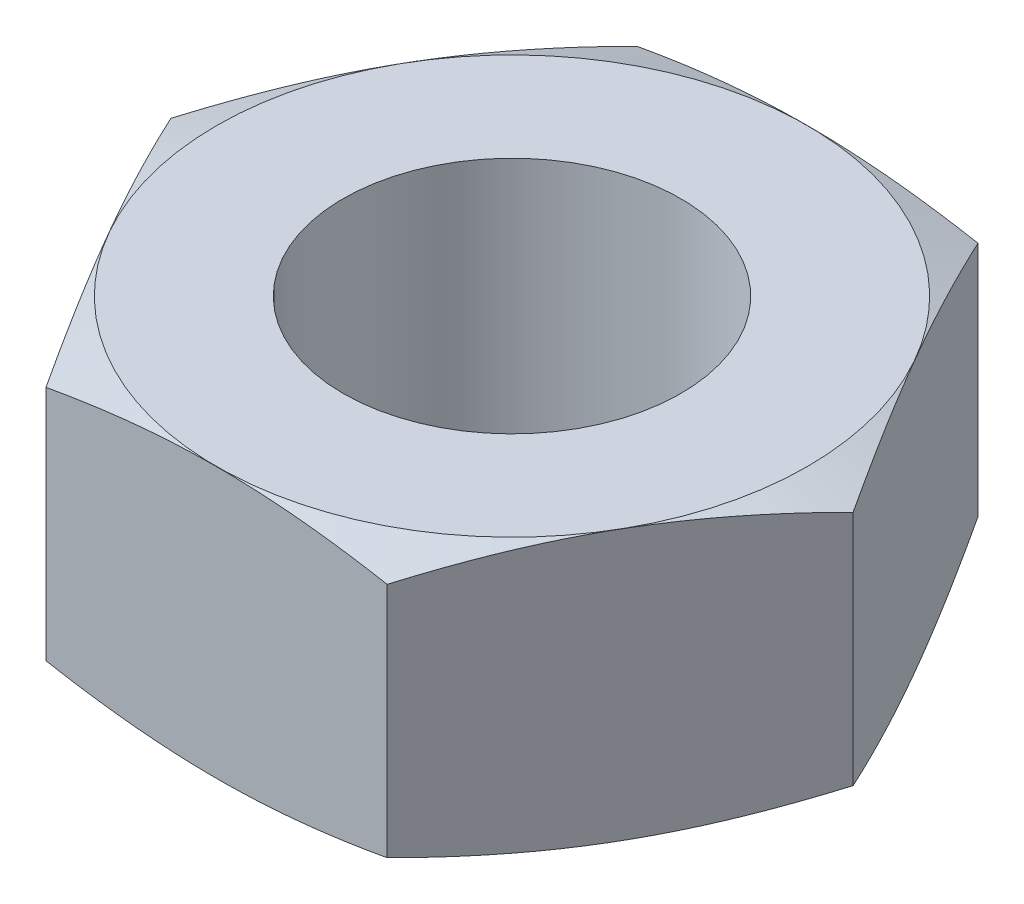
ISO-10303-21;
HEADER;
FILE_DESCRIPTION(('STEP AP214'),'2;1');
FILE_NAME('part.step','',(''),(''),'','','');
FILE_SCHEMA(('AUTOMOTIVE_DESIGN { 1 0 10303 214 1 1 1 1 }'));
ENDSEC;
DATA;
#1=APPLICATION_CONTEXT('core data for automotive mechanical design processes');
#2=APPLICATION_PROTOCOL_DEFINITION('international standard','automotive_design',2000,#1);
#3=PRODUCT_CONTEXT('',#1,'mechanical');
#4=PRODUCT('Part','Part','',(#3));
#5=PRODUCT_RELATED_PRODUCT_CATEGORY('part','',(#4));
#6=PRODUCT_DEFINITION_FORMATION('','',#4);
#7=PRODUCT_DEFINITION_CONTEXT('part definition',#1,'design');
#8=PRODUCT_DEFINITION('design','',#6,#7);
#9=PRODUCT_DEFINITION_SHAPE('','',#8);
#10=(LENGTH_UNIT() NAMED_UNIT(*) SI_UNIT(.MILLI.,.METRE.));
#11=(NAMED_UNIT(*) PLANE_ANGLE_UNIT() SI_UNIT($,.RADIAN.));
#12=(NAMED_UNIT(*) SI_UNIT($,.STERADIAN.) SOLID_ANGLE_UNIT());
#13=UNCERTAINTY_MEASURE_WITH_UNIT(LENGTH_MEASURE(1.E-05),#10,'distance_accuracy_value','');
#14=(GEOMETRIC_REPRESENTATION_CONTEXT(3) GLOBAL_UNCERTAINTY_ASSIGNED_CONTEXT((#13)) GLOBAL_UNIT_ASSIGNED_CONTEXT((#10,
#11,#12)) REPRESENTATION_CONTEXT('',''));
#15=CARTESIAN_POINT('',(0.,0.,0.));
#16=DIRECTION('',(0.,0.,1.));
#17=DIRECTION('',(1.,0.,0.));
#18=AXIS2_PLACEMENT_3D('',#15,#16,#17);
#19=CARTESIAN_POINT('',(0.,1.6,0.));
#20=DIRECTION('',(0.,1.,0.));
#21=DIRECTION('',(0.,0.,1.));
#22=AXIS2_PLACEMENT_3D('',#19,#20,#21);
#23=PLANE('',#22);
#24=CARTESIAN_POINT('',(0.,1.6,0.));
#25=DIRECTION('',(0.,1.,0.));
#26=DIRECTION('',(0.,0.,1.));
#27=AXIS2_PLACEMENT_3D('',#24,#25,#26);
#28=CIRCLE('',#27,2.);
#29=CARTESIAN_POINT('',(0.,1.6,2.));
#30=VERTEX_POINT('',#29);
#31=EDGE_CURVE('E192',#30,#30,#28,.T.);
#32=ORIENTED_EDGE('',*,*,#31,.F.);
#33=EDGE_LOOP('',(#32));
#34=FACE_BOUND('',#33,.T.);
#35=CARTESIAN_POINT('',(0.,1.60000000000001,0.));
#36=DIRECTION('',(0.,-1.,0.));
#37=DIRECTION('',(1.,0.,0.));
#38=AXIS2_PLACEMENT_3D('',#35,#36,#37);
#39=CIRCLE('',#38,3.49895188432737);
#40=CARTESIAN_POINT('',(3.49895188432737,1.60000000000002,0.));
#41=VERTEX_POINT('',#40);
#42=EDGE_CURVE('E213',#41,#41,#39,.T.);
#43=ORIENTED_EDGE('',*,*,#42,.F.);
#44=EDGE_LOOP('',(#43));
#45=FACE_BOUND('',#44,.T.);
#46=ADVANCED_FACE('F34',(#34,#45),#23,.T.);
#47=CARTESIAN_POINT('',(0.,-1.6,0.));
#48=DIRECTION('',(0.,1.,0.));
#49=DIRECTION('',(0.,0.,1.));
#50=AXIS2_PLACEMENT_3D('',#47,#48,#49);
#51=PLANE('',#50);
#52=CARTESIAN_POINT('',(0.,-1.6,0.));
#53=DIRECTION('',(0.,1.,0.));
#54=DIRECTION('',(0.,0.,1.));
#55=AXIS2_PLACEMENT_3D('',#52,#53,#54);
#56=CIRCLE('',#55,2.);
#57=CARTESIAN_POINT('',(0.,-1.6,2.));
#58=VERTEX_POINT('',#57);
#59=EDGE_CURVE('E191',#58,#58,#56,.T.);
#60=ORIENTED_EDGE('',*,*,#59,.T.);
#61=EDGE_LOOP('',(#60));
#62=FACE_BOUND('',#61,.T.);
#63=CARTESIAN_POINT('',(0.,-1.59999999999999,0.));
#64=DIRECTION('',(0.,-1.,0.));
#65=DIRECTION('',(1.,0.,0.));
#66=AXIS2_PLACEMENT_3D('',#63,#64,#65);
#67=CIRCLE('',#66,3.49895188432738);
#68=CARTESIAN_POINT('',(3.49895188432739,-1.59999999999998,0.));
#69=VERTEX_POINT('',#68);
#70=EDGE_CURVE('E216',#69,#69,#67,.T.);
#71=ORIENTED_EDGE('',*,*,#70,.T.);
#72=EDGE_LOOP('',(#71));
#73=FACE_BOUND('',#72,.T.);
#74=ADVANCED_FACE('F223',(#62,#73),#51,.F.);
#75=CARTESIAN_POINT('',(0.,1.6,0.));
#76=DIRECTION('',(0.,-1.,0.));
#77=DIRECTION('',(0.,0.,-1.));
#78=AXIS2_PLACEMENT_3D('',#75,#76,#77);
#79=CYLINDRICAL_SURFACE('',#78,2.);
#80=ORIENTED_EDGE('',*,*,#31,.T.);
#81=EDGE_LOOP('',(#80));
#82=FACE_BOUND('',#81,.T.);
#83=ORIENTED_EDGE('',*,*,#59,.F.);
#84=EDGE_LOOP('',(#83));
#85=FACE_BOUND('',#84,.T.);
#86=ADVANCED_FACE('F129',(#82,#85),#79,.F.);
#87=CARTESIAN_POINT('',(0.,-1.59999999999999,0.));
#88=DIRECTION('',(0.,1.,0.));
#89=DIRECTION('',(-1.,0.,0.));
#90=AXIS2_PLACEMENT_3D('',#87,#88,#89);
#91=CONICAL_SURFACE('',#90,3.49895188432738,1.22173047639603);
#92=ORIENTED_EDGE('',*,*,#70,.F.);
#93=EDGE_LOOP('',(#92));
#94=FACE_BOUND('',#93,.T.);
#95=CARTESIAN_POINT('',(4.04156735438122,-1.40250411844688,-0.000200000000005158));
#96=CARTESIAN_POINT('',(3.95787514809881,-1.43297821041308,0.144759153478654));
#97=CARTESIAN_POINT('',(3.87390694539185,-1.46069976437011,0.290196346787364));
#98=CARTESIAN_POINT('',(3.70542452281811,-1.50947166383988,0.58201646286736));
#99=CARTESIAN_POINT('',(3.62090992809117,-1.53051678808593,0.728400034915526));
#100=CARTESIAN_POINT('',(3.45227272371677,-1.5645567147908,1.02048824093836));
#101=CARTESIAN_POINT('',(3.36815396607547,-1.5776257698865,1.16618620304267));
#102=CARTESIAN_POINT('',(3.19971971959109,-1.59515505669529,1.45792287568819));
#103=CARTESIAN_POINT('',(3.11540431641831,-1.59961851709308,1.60396143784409));
#104=CARTESIAN_POINT('',(2.94677351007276,-1.59961851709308,1.8960385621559));
#105=CARTESIAN_POINT('',(2.86245810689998,-1.59515505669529,2.04207712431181));
#106=CARTESIAN_POINT('',(2.6940238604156,-1.5776257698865,2.33381379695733));
#107=CARTESIAN_POINT('',(2.6099051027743,-1.5645567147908,2.47951175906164));
#108=CARTESIAN_POINT('',(2.4412678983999,-1.53051678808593,2.77159996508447));
#109=CARTESIAN_POINT('',(2.35675330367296,-1.50947166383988,2.91798353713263));
#110=CARTESIAN_POINT('',(2.18827088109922,-1.46069976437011,3.20980365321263));
#111=CARTESIAN_POINT('',(2.10430267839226,-1.43297821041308,3.35524084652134));
#112=CARTESIAN_POINT('',(2.02061047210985,-1.40250411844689,3.5002));
#113=B_SPLINE_CURVE_WITH_KNOTS('',3,(#95,#96,#97,#98,#99,#100,#101,#102,#103,#104,#105,#106,
#107,#108,#109,#110,#111,#112),.UNSPECIFIED.,.F.,.F.,(4,2,2,2,2,2,2,2,4),(0.,0.510460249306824,
1.02131872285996,1.52734581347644,2.03318301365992,2.53902021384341,3.04504730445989,
3.55590577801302,4.06636602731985),.UNSPECIFIED.);
#114=CARTESIAN_POINT('',(4.04145188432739,-1.40254614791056,0.));
#115=VERTEX_POINT('',#114);
#116=CARTESIAN_POINT('',(2.02072594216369,-1.40254614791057,3.5));
#117=VERTEX_POINT('',#116);
#118=EDGE_CURVE('E63',#115,#117,#113,.T.);
#119=ORIENTED_EDGE('',*,*,#118,.T.);
#120=CARTESIAN_POINT('',(6.06719846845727,-0.324139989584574,3.5));
#121=CARTESIAN_POINT('',(5.94740339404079,-0.361906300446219,3.5));
#122=CARTESIAN_POINT('',(5.8275293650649,-0.399422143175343,3.5));
#123=CARTESIAN_POINT('',(5.58759785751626,-0.473868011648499,3.5));
#124=CARTESIAN_POINT('',(5.46754037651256,-0.510798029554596,3.5));
#125=CARTESIAN_POINT('',(5.10700549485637,-0.620596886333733,3.5));
#126=CARTESIAN_POINT('',(4.86621922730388,-0.692457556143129,3.5));
#127=CARTESIAN_POINT('',(4.38002657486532,-0.8335667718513,3.5));
#128=CARTESIAN_POINT('',(4.13460440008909,-0.902761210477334,3.5));
#129=CARTESIAN_POINT('',(3.64234516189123,-1.03593253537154,3.5));
#130=CARTESIAN_POINT('',(3.39550815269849,-1.09990962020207,3.5));
#131=CARTESIAN_POINT('',(2.91058425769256,-1.21793337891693,3.5));
#132=CARTESIAN_POINT('',(2.67257317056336,-1.2722872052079,3.5));
#133=CARTESIAN_POINT('',(2.19455006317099,-1.37161209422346,3.5));
#134=CARTESIAN_POINT('',(1.95453790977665,-1.41658252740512,3.5));
#135=CARTESIAN_POINT('',(1.47425115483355,-1.49342510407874,3.5));
#136=CARTESIAN_POINT('',(1.23399307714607,-1.52539628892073,3.5));
#137=CARTESIAN_POINT('',(0.872447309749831,-1.56131796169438,3.5));
#138=CARTESIAN_POINT('',(0.751748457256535,-1.57128569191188,3.5));
#139=CARTESIAN_POINT('',(0.510074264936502,-1.58688852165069,3.5));
#140=CARTESIAN_POINT('',(0.389098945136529,-1.59252392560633,3.5));
#141=CARTESIAN_POINT('',(0.136340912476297,-1.59954842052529,3.5));
#142=CARTESIAN_POINT('',(0.00454627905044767,-1.60051905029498,3.5));
#143=CARTESIAN_POINT('',(-0.258971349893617,-1.59703564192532,3.5));
#144=CARTESIAN_POINT('',(-0.390694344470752,-1.59258153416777,3.5));
#145=CARTESIAN_POINT('',(-0.653890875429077,-1.57844389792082,3.5));
#146=CARTESIAN_POINT('',(-0.785364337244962,-1.56875899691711,3.5));
#147=CARTESIAN_POINT('',(-1.0478701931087,-1.54455458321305,3.5));
#148=CARTESIAN_POINT('',(-1.17890254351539,-1.53003460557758,3.5));
#149=CARTESIAN_POINT('',(-1.57332815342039,-1.47972295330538,3.5));
#150=CARTESIAN_POINT('',(-1.83588142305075,-1.43731124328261,3.5));
#151=CARTESIAN_POINT('',(-2.35848948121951,-1.33956092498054,3.5));
#152=CARTESIAN_POINT('',(-2.61854405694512,-1.28422122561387,3.5));
#153=CARTESIAN_POINT('',(-3.14898695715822,-1.16160899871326,3.5));
#154=CARTESIAN_POINT('',(-3.41927070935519,-1.0938905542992,3.5));
#155=CARTESIAN_POINT('',(-3.95800886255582,-0.951643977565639,3.5));
#156=CARTESIAN_POINT('',(-4.22646329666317,-0.877115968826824,3.5));
#157=CARTESIAN_POINT('',(-4.75754455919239,-0.724606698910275,3.5));
#158=CARTESIAN_POINT('',(-5.02019398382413,-0.64670361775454,3.5));
#159=CARTESIAN_POINT('',(-5.41338234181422,-0.527401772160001,3.5));
#160=CARTESIAN_POINT('',(-5.54429693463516,-0.487232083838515,3.5));
#161=CARTESIAN_POINT('',(-5.80590502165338,-0.406187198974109,3.5));
#162=CARTESIAN_POINT('',(-5.93659851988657,-0.365312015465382,3.5));
#163=CARTESIAN_POINT('',(-6.06719846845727,-0.324139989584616,3.5));
#164=B_SPLINE_CURVE_WITH_KNOTS('',3,(#120,#121,#122,#123,#124,#125,#126,#127,#128,#129,#130,
#131,#132,#133,#134,#135,#136,#137,#138,#139,#140,#141,#142,#143,#144,#145,#146,#147,#148,#149,
#150,#151,#152,#153,#154,#155,#156,#157,#158,#159,#160,#161,#162,#163),.UNSPECIFIED.,.F.,.F.,(4,
2,2,2,2,2,2,2,2,2,2,2,2,2,2,2,2,2,2,2,2,4),(0.,0.376820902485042,0.75364684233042,
1.507467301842,2.27239773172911,3.03729903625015,3.76957796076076,4.50190599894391,
5.2285448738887,5.59180733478,5.95504426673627,6.35032543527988,6.7456116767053,
7.14100168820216,7.53642973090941,8.33378902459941,9.13121563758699,9.96699633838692,
10.8027618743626,11.6246087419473,12.0354237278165,12.4462311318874),.UNSPECIFIED.);
#165=CARTESIAN_POINT('',(-2.02072594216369,-1.40254614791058,3.5));
#166=VERTEX_POINT('',#165);
#167=EDGE_CURVE('E49',#117,#166,#164,.T.);
#168=ORIENTED_EDGE('',*,*,#167,.T.);
#169=CARTESIAN_POINT('',(-2.02061047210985,-1.4025041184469,3.5002));
#170=CARTESIAN_POINT('',(-2.10430267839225,-1.43297821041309,3.35524084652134));
#171=CARTESIAN_POINT('',(-2.18827088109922,-1.46069976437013,3.20980365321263));
#172=CARTESIAN_POINT('',(-2.35675330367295,-1.5094716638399,2.91798353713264));
#173=CARTESIAN_POINT('',(-2.4412678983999,-1.53051678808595,2.77159996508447));
#174=CARTESIAN_POINT('',(-2.6099051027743,-1.56455671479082,2.47951175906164));
#175=CARTESIAN_POINT('',(-2.6940238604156,-1.57762576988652,2.33381379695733));
#176=CARTESIAN_POINT('',(-2.86245810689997,-1.59515505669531,2.04207712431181));
#177=CARTESIAN_POINT('',(-2.94677351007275,-1.5996185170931,1.89603856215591));
#178=CARTESIAN_POINT('',(-3.11540431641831,-1.5996185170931,1.6039614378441));
#179=CARTESIAN_POINT('',(-3.19971971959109,-1.59515505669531,1.45792287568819));
#180=CARTESIAN_POINT('',(-3.36815396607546,-1.57762576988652,1.16618620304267));
#181=CARTESIAN_POINT('',(-3.45227272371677,-1.56455671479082,1.02048824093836));
#182=CARTESIAN_POINT('',(-3.62090992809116,-1.53051678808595,0.728400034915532));
#183=CARTESIAN_POINT('',(-3.70542452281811,-1.5094716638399,0.582016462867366));
#184=CARTESIAN_POINT('',(-3.87390694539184,-1.46069976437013,0.29019634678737));
#185=CARTESIAN_POINT('',(-3.95787514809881,-1.4329782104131,0.14475915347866));
#186=CARTESIAN_POINT('',(-4.04156735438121,-1.40250411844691,-0.000199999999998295));
#187=B_SPLINE_CURVE_WITH_KNOTS('',3,(#169,#170,#171,#172,#173,#174,#175,#176,#177,#178,#179,
#180,#181,#182,#183,#184,#185,#186),.UNSPECIFIED.,.F.,.F.,(4,2,2,2,2,2,2,2,4),(0.,
0.510460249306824,1.02131872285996,1.52734581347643,2.03318301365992,2.53902021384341,
3.04504730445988,3.55590577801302,4.06636602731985),.UNSPECIFIED.);
#188=CARTESIAN_POINT('',(-4.04145188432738,-1.40254614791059,0.));
#189=VERTEX_POINT('',#188);
#190=EDGE_CURVE('E138',#166,#189,#187,.T.);
#191=ORIENTED_EDGE('',*,*,#190,.T.);
#192=CARTESIAN_POINT('',(-4.04156735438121,-1.40250411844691,0.000200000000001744));
#193=CARTESIAN_POINT('',(-3.95787514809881,-1.4329782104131,-0.144759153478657));
#194=CARTESIAN_POINT('',(-3.87390694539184,-1.46069976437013,-0.290196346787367));
#195=CARTESIAN_POINT('',(-3.70542452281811,-1.5094716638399,-0.582016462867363));
#196=CARTESIAN_POINT('',(-3.62090992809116,-1.53051678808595,-0.728400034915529));
#197=CARTESIAN_POINT('',(-3.45227272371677,-1.56455671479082,-1.02048824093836));
#198=CARTESIAN_POINT('',(-3.36815396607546,-1.57762576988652,-1.16618620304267));
#199=CARTESIAN_POINT('',(-3.19971971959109,-1.59515505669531,-1.45792287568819));
#200=CARTESIAN_POINT('',(-3.11540431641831,-1.5996185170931,-1.60396143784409));
#201=CARTESIAN_POINT('',(-2.94677351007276,-1.5996185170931,-1.89603856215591));
#202=CARTESIAN_POINT('',(-2.86245810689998,-1.59515505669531,-2.04207712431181));
#203=CARTESIAN_POINT('',(-2.6940238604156,-1.57762576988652,-2.33381379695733));
#204=CARTESIAN_POINT('',(-2.6099051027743,-1.56455671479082,-2.47951175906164));
#205=CARTESIAN_POINT('',(-2.4412678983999,-1.53051678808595,-2.77159996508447));
#206=CARTESIAN_POINT('',(-2.35675330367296,-1.5094716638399,-2.91798353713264));
#207=CARTESIAN_POINT('',(-2.18827088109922,-1.46069976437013,-3.20980365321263));
#208=CARTESIAN_POINT('',(-2.10430267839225,-1.43297821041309,-3.35524084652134));
#209=CARTESIAN_POINT('',(-2.02061047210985,-1.4025041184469,-3.5002));
#210=B_SPLINE_CURVE_WITH_KNOTS('',3,(#192,#193,#194,#195,#196,#197,#198,#199,#200,#201,#202,
#203,#204,#205,#206,#207,#208,#209),.UNSPECIFIED.,.F.,.F.,(4,2,2,2,2,2,2,2,4),(0.,
0.510460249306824,1.02131872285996,1.52734581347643,2.03318301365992,2.53902021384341,
3.04504730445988,3.55590577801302,4.06636602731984),.UNSPECIFIED.);
#211=CARTESIAN_POINT('',(-2.02072594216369,-1.40254614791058,-3.5));
#212=VERTEX_POINT('',#211);
#213=EDGE_CURVE('E146',#189,#212,#210,.T.);
#214=ORIENTED_EDGE('',*,*,#213,.T.);
#215=CARTESIAN_POINT('',(-6.06719846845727,-0.324139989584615,-3.5));
#216=CARTESIAN_POINT('',(-5.94740339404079,-0.361906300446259,-3.5));
#217=CARTESIAN_POINT('',(-5.8275293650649,-0.399422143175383,-3.5));
#218=CARTESIAN_POINT('',(-5.58759785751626,-0.473868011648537,-3.5));
#219=CARTESIAN_POINT('',(-5.46754037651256,-0.510798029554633,-3.5));
#220=CARTESIAN_POINT('',(-5.10700549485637,-0.620596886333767,-3.5));
#221=CARTESIAN_POINT('',(-4.86621922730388,-0.692457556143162,-3.5));
#222=CARTESIAN_POINT('',(-4.38002657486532,-0.83356677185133,-3.5));
#223=CARTESIAN_POINT('',(-4.13460440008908,-0.902761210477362,-3.5));
#224=CARTESIAN_POINT('',(-3.64234516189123,-1.03593253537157,-3.5));
#225=CARTESIAN_POINT('',(-3.39550815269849,-1.0999096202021,-3.5));
#226=CARTESIAN_POINT('',(-2.91058425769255,-1.21793337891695,-3.5));
#227=CARTESIAN_POINT('',(-2.67257317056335,-1.27228720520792,-3.5));
#228=CARTESIAN_POINT('',(-2.19455006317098,-1.37161209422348,-3.5));
#229=CARTESIAN_POINT('',(-1.95453790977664,-1.41658252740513,-3.5));
#230=CARTESIAN_POINT('',(-1.47425115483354,-1.49342510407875,-3.5));
#231=CARTESIAN_POINT('',(-1.23399307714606,-1.52539628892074,-3.5));
#232=CARTESIAN_POINT('',(-0.872447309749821,-1.56131796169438,-3.5));
#233=CARTESIAN_POINT('',(-0.751748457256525,-1.57128569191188,-3.5));
#234=CARTESIAN_POINT('',(-0.510074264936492,-1.58688852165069,-3.5));
#235=CARTESIAN_POINT('',(-0.389098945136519,-1.59252392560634,-3.5));
#236=CARTESIAN_POINT('',(-0.136340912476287,-1.59954842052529,-3.5));
#237=CARTESIAN_POINT('',(-0.00454627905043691,-1.60051905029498,-3.5));
#238=CARTESIAN_POINT('',(0.258971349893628,-1.59703564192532,-3.5));
#239=CARTESIAN_POINT('',(0.390694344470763,-1.59258153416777,-3.5));
#240=CARTESIAN_POINT('',(0.653890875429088,-1.57844389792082,-3.5));
#241=CARTESIAN_POINT('',(0.785364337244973,-1.5687589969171,-3.5));
#242=CARTESIAN_POINT('',(1.04787019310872,-1.54455458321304,-3.5));
#243=CARTESIAN_POINT('',(1.1789025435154,-1.53003460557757,-3.5));
#244=CARTESIAN_POINT('',(1.5733281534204,-1.47972295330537,-3.5));
#245=CARTESIAN_POINT('',(1.83588142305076,-1.4373112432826,-3.5));
#246=CARTESIAN_POINT('',(2.35848948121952,-1.33956092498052,-3.5));
#247=CARTESIAN_POINT('',(2.61854405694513,-1.28422122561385,-3.5));
#248=CARTESIAN_POINT('',(3.14898695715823,-1.16160899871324,-3.5));
#249=CARTESIAN_POINT('',(3.4192707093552,-1.09389055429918,-3.5));
#250=CARTESIAN_POINT('',(3.95800886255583,-0.95164397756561,-3.5));
#251=CARTESIAN_POINT('',(4.22646329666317,-0.877115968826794,-3.5));
#252=CARTESIAN_POINT('',(4.7575445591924,-0.724606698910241,-3.5));
#253=CARTESIAN_POINT('',(5.02019398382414,-0.646703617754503,-3.5));
#254=CARTESIAN_POINT('',(5.41338234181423,-0.527401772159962,-3.5));
#255=CARTESIAN_POINT('',(5.54429693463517,-0.487232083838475,-3.5));
#256=CARTESIAN_POINT('',(5.80590502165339,-0.406187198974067,-3.5));
#257=CARTESIAN_POINT('',(5.93659851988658,-0.365312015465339,-3.5));
#258=CARTESIAN_POINT('',(6.06719846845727,-0.324139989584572,-3.5));
#259=B_SPLINE_CURVE_WITH_KNOTS('',3,(#215,#216,#217,#218,#219,#220,#221,#222,#223,#224,#225,
#226,#227,#228,#229,#230,#231,#232,#233,#234,#235,#236,#237,#238,#239,#240,#241,#242,#243,#244,
#245,#246,#247,#248,#249,#250,#251,#252,#253,#254,#255,#256,#257,#258),.UNSPECIFIED.,.F.,.F.,(4,
2,2,2,2,2,2,2,2,2,2,2,2,2,2,2,2,2,2,2,2,4),(0.,0.376820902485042,0.753646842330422,
1.507467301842,2.27239773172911,3.03729903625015,3.76957796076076,4.50190599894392,
5.2285448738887,5.59180733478,5.95504426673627,6.35032543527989,6.74561167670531,
7.14100168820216,7.53642973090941,8.33378902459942,9.131215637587,9.96699633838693,
10.8027618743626,11.6246087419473,12.0354237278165,12.4462311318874),.UNSPECIFIED.);
#260=CARTESIAN_POINT('',(2.0207259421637,-1.40254614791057,-3.5));
#261=VERTEX_POINT('',#260);
#262=EDGE_CURVE('E94',#212,#261,#259,.T.);
#263=ORIENTED_EDGE('',*,*,#262,.T.);
#264=CARTESIAN_POINT('',(2.02061047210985,-1.40250411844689,-3.5002));
#265=CARTESIAN_POINT('',(2.10430267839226,-1.43297821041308,-3.35524084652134));
#266=CARTESIAN_POINT('',(2.18827088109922,-1.46069976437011,-3.20980365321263));
#267=CARTESIAN_POINT('',(2.35675330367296,-1.50947166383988,-2.91798353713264));
#268=CARTESIAN_POINT('',(2.4412678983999,-1.53051678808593,-2.77159996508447));
#269=CARTESIAN_POINT('',(2.6099051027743,-1.5645567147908,-2.47951175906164));
#270=CARTESIAN_POINT('',(2.6940238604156,-1.5776257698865,-2.33381379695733));
#271=CARTESIAN_POINT('',(2.86245810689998,-1.59515505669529,-2.04207712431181));
#272=CARTESIAN_POINT('',(2.94677351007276,-1.59961851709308,-1.89603856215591));
#273=CARTESIAN_POINT('',(3.11540431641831,-1.59961851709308,-1.6039614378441));
#274=CARTESIAN_POINT('',(3.19971971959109,-1.59515505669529,-1.45792287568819));
#275=CARTESIAN_POINT('',(3.36815396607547,-1.5776257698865,-1.16618620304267));
#276=CARTESIAN_POINT('',(3.45227272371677,-1.5645567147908,-1.02048824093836));
#277=CARTESIAN_POINT('',(3.62090992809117,-1.53051678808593,-0.728400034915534));
#278=CARTESIAN_POINT('',(3.70542452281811,-1.50947166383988,-0.582016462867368));
#279=CARTESIAN_POINT('',(3.87390694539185,-1.46069976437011,-0.290196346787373));
#280=CARTESIAN_POINT('',(3.95787514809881,-1.43297821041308,-0.144759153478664));
#281=CARTESIAN_POINT('',(4.04156735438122,-1.40250411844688,0.000199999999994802));
#282=B_SPLINE_CURVE_WITH_KNOTS('',3,(#264,#265,#266,#267,#268,#269,#270,#271,#272,#273,#274,
#275,#276,#277,#278,#279,#280,#281),.UNSPECIFIED.,.F.,.F.,(4,2,2,2,2,2,2,2,4),(0.,
0.510460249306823,1.02131872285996,1.52734581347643,2.03318301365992,2.53902021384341,
3.04504730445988,3.55590577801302,4.06636602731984),.UNSPECIFIED.);
#283=EDGE_CURVE('E91',#261,#115,#282,.T.);
#284=ORIENTED_EDGE('',*,*,#283,.T.);
#285=EDGE_LOOP('',(#119,#168,#191,#214,#263,#284));
#286=FACE_BOUND('',#285,.T.);
#287=ADVANCED_FACE('F92',(#94,#286),#91,.T.);
#288=CARTESIAN_POINT('',(0.,1.4025461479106,0.));
#289=DIRECTION('',(0.,-1.,0.));
#290=DIRECTION('',(1.,0.,0.));
#291=AXIS2_PLACEMENT_3D('',#288,#289,#290);
#292=CONICAL_SURFACE('',#291,4.04145188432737,1.22173047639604);
#293=ORIENTED_EDGE('',*,*,#42,.T.);
#294=EDGE_LOOP('',(#293));
#295=FACE_BOUND('',#294,.T.);
#296=CARTESIAN_POINT('',(2.02061047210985,1.40250411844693,3.5002));
#297=CARTESIAN_POINT('',(2.10430267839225,1.43297821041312,3.35524084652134));
#298=CARTESIAN_POINT('',(2.18827088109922,1.46069976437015,3.20980365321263));
#299=CARTESIAN_POINT('',(2.35675330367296,1.50947166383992,2.91798353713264));
#300=CARTESIAN_POINT('',(2.4412678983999,1.53051678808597,2.77159996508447));
#301=CARTESIAN_POINT('',(2.6099051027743,1.56455671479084,2.47951175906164));
#302=CARTESIAN_POINT('',(2.6940238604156,1.57762576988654,2.33381379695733));
#303=CARTESIAN_POINT('',(2.86245810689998,1.59515505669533,2.04207712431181));
#304=CARTESIAN_POINT('',(2.94677351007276,1.59961851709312,1.8960385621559));
#305=CARTESIAN_POINT('',(3.11540431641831,1.59961851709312,1.60396143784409));
#306=CARTESIAN_POINT('',(3.19971971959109,1.59515505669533,1.45792287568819));
#307=CARTESIAN_POINT('',(3.36815396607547,1.57762576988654,1.16618620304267));
#308=CARTESIAN_POINT('',(3.45227272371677,1.56455671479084,1.02048824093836));
#309=CARTESIAN_POINT('',(3.62090992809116,1.53051678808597,0.728400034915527));
#310=CARTESIAN_POINT('',(3.70542452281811,1.50947166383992,0.582016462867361));
#311=CARTESIAN_POINT('',(3.87390694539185,1.46069976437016,0.290196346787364));
#312=CARTESIAN_POINT('',(3.95787514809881,1.43297821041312,0.144759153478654));
#313=CARTESIAN_POINT('',(4.04156735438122,1.40250411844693,-0.000200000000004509));
#314=B_SPLINE_CURVE_WITH_KNOTS('',3,(#296,#297,#298,#299,#300,#301,#302,#303,#304,#305,#306,
#307,#308,#309,#310,#311,#312,#313),.UNSPECIFIED.,.F.,.F.,(4,2,2,2,2,2,2,2,4),(0.,
0.510460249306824,1.02131872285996,1.52734581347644,2.03318301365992,2.53902021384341,
3.04504730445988,3.55590577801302,4.06636602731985),.UNSPECIFIED.);
#315=CARTESIAN_POINT('',(2.02072594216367,1.40254614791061,3.5));
#316=VERTEX_POINT('',#315);
#317=CARTESIAN_POINT('',(4.04145188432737,1.40254614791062,0.));
#318=VERTEX_POINT('',#317);
#319=EDGE_CURVE('E179',#316,#318,#314,.T.);
#320=ORIENTED_EDGE('',*,*,#319,.T.);
#321=CARTESIAN_POINT('',(4.04156735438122,1.40250411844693,0.000199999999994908));
#322=CARTESIAN_POINT('',(3.95787514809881,1.43297821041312,-0.144759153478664));
#323=CARTESIAN_POINT('',(3.87390694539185,1.46069976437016,-0.290196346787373));
#324=CARTESIAN_POINT('',(3.70542452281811,1.50947166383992,-0.582016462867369));
#325=CARTESIAN_POINT('',(3.62090992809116,1.53051678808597,-0.728400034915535));
#326=CARTESIAN_POINT('',(3.45227272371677,1.56455671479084,-1.02048824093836));
#327=CARTESIAN_POINT('',(3.36815396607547,1.57762576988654,-1.16618620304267));
#328=CARTESIAN_POINT('',(3.19971971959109,1.59515505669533,-1.45792287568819));
#329=CARTESIAN_POINT('',(3.11540431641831,1.59961851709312,-1.6039614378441));
#330=CARTESIAN_POINT('',(2.94677351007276,1.59961851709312,-1.89603856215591));
#331=CARTESIAN_POINT('',(2.86245810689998,1.59515505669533,-2.04207712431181));
#332=CARTESIAN_POINT('',(2.6940238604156,1.57762576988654,-2.33381379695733));
#333=CARTESIAN_POINT('',(2.6099051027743,1.56455671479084,-2.47951175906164));
#334=CARTESIAN_POINT('',(2.4412678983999,1.53051678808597,-2.77159996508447));
#335=CARTESIAN_POINT('',(2.35675330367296,1.50947166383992,-2.91798353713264));
#336=CARTESIAN_POINT('',(2.18827088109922,1.46069976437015,-3.20980365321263));
#337=CARTESIAN_POINT('',(2.10430267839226,1.43297821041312,-3.35524084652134));
#338=CARTESIAN_POINT('',(2.02061047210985,1.40250411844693,-3.5002));
#339=B_SPLINE_CURVE_WITH_KNOTS('',3,(#321,#322,#323,#324,#325,#326,#327,#328,#329,#330,#331,
#332,#333,#334,#335,#336,#337,#338),.UNSPECIFIED.,.F.,.F.,(4,2,2,2,2,2,2,2,4),(0.,
0.510460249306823,1.02131872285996,1.52734581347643,2.03318301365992,2.53902021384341,
3.04504730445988,3.55590577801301,4.06636602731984),.UNSPECIFIED.);
#340=CARTESIAN_POINT('',(2.02072594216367,1.40254614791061,-3.5));
#341=VERTEX_POINT('',#340);
#342=EDGE_CURVE('E110',#318,#341,#339,.T.);
#343=ORIENTED_EDGE('',*,*,#342,.T.);
#344=CARTESIAN_POINT('',(6.06719846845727,0.32413998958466,-3.5));
#345=CARTESIAN_POINT('',(5.94740339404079,0.361906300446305,-3.5));
#346=CARTESIAN_POINT('',(5.8275293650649,0.399422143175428,-3.5));
#347=CARTESIAN_POINT('',(5.58759785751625,0.473868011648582,-3.5));
#348=CARTESIAN_POINT('',(5.46754037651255,0.510798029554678,-3.5));
#349=CARTESIAN_POINT('',(5.10700549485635,0.620596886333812,-3.5));
#350=CARTESIAN_POINT('',(4.86621922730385,0.692457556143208,-3.5));
#351=CARTESIAN_POINT('',(4.38002657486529,0.833566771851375,-3.5));
#352=CARTESIAN_POINT('',(4.13460440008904,0.902761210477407,-3.5));
#353=CARTESIAN_POINT('',(3.64234516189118,1.03593253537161,-3.5));
#354=CARTESIAN_POINT('',(3.39550815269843,1.09990962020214,-3.5));
#355=CARTESIAN_POINT('',(2.91058425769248,1.21793337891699,-3.5));
#356=CARTESIAN_POINT('',(2.67257317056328,1.27228720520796,-3.5));
#357=CARTESIAN_POINT('',(2.1945500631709,1.37161209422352,-3.5));
#358=CARTESIAN_POINT('',(1.95453790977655,1.41658252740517,-3.5));
#359=CARTESIAN_POINT('',(1.47425115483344,1.49342510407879,-3.5));
#360=CARTESIAN_POINT('',(1.23399307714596,1.52539628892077,-3.5));
#361=CARTESIAN_POINT('',(0.87244730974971,1.56131796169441,-3.5));
#362=CARTESIAN_POINT('',(0.751748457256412,1.57128569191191,-3.5));
#363=CARTESIAN_POINT('',(0.510074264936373,1.58688852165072,-3.5));
#364=CARTESIAN_POINT('',(0.389098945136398,1.59252392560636,-3.5));
#365=CARTESIAN_POINT('',(0.136340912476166,1.59954842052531,-3.5));
#366=CARTESIAN_POINT('',(0.00454627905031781,1.600519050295,-3.5));
#367=CARTESIAN_POINT('',(-0.258971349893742,1.59703564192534,-3.5));
#368=CARTESIAN_POINT('',(-0.390694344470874,1.59258153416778,-3.5));
#369=CARTESIAN_POINT('',(-0.653890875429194,1.57844389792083,-3.5));
#370=CARTESIAN_POINT('',(-0.785364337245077,1.56875899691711,-3.5));
#371=CARTESIAN_POINT('',(-1.04787019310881,1.54455458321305,-3.5));
#372=CARTESIAN_POINT('',(-1.1789025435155,1.53003460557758,-3.5));
#373=CARTESIAN_POINT('',(-1.57332815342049,1.47972295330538,-3.5));
#374=CARTESIAN_POINT('',(-1.83588142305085,1.4373112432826,-3.5));
#375=CARTESIAN_POINT('',(-2.35848948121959,1.33956092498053,-3.5));
#376=CARTESIAN_POINT('',(-2.6185440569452,1.28422122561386,-3.5));
#377=CARTESIAN_POINT('',(-3.14898695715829,1.16160899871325,-3.5));
#378=CARTESIAN_POINT('',(-3.41927070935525,1.09389055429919,-3.5));
#379=CARTESIAN_POINT('',(-3.95800886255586,0.951643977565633,-3.5));
#380=CARTESIAN_POINT('',(-4.22646329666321,0.87711596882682,-3.5));
#381=CARTESIAN_POINT('',(-4.75754455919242,0.724606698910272,-3.5));
#382=CARTESIAN_POINT('',(-5.02019398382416,0.646703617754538,-3.5));
#383=CARTESIAN_POINT('',(-5.41338234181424,0.527401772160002,-3.5));
#384=CARTESIAN_POINT('',(-5.54429693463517,0.487232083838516,-3.5));
#385=CARTESIAN_POINT('',(-5.8059050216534,0.40618719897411,-3.5));
#386=CARTESIAN_POINT('',(-5.93659851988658,0.365312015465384,-3.5));
#387=CARTESIAN_POINT('',(-6.06719846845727,0.32413998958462,-3.5));
#388=B_SPLINE_CURVE_WITH_KNOTS('',3,(#344,#345,#346,#347,#348,#349,#350,#351,#352,#353,#354,
#355,#356,#357,#358,#359,#360,#361,#362,#363,#364,#365,#366,#367,#368,#369,#370,#371,#372,#373,
#374,#375,#376,#377,#378,#379,#380,#381,#382,#383,#384,#385,#386,#387),.UNSPECIFIED.,.F.,.F.,(4,
2,2,2,2,2,2,2,2,2,2,2,2,2,2,2,2,2,2,2,2,4),(0.,0.376820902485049,0.753646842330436,
1.50746730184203,2.27239773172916,3.03729903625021,3.76957796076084,4.501905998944,
5.22854487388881,5.59180733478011,5.95504426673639,6.35032543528,6.74561167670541,
7.14100168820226,7.5364297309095,8.33378902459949,9.13121563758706,9.96699633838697,
10.8027618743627,11.6246087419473,12.0354237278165,12.4462311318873),.UNSPECIFIED.);
#389=CARTESIAN_POINT('',(-2.0207259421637,1.4025461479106,-3.49999999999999));
#390=VERTEX_POINT('',#389);
#391=EDGE_CURVE('E180',#341,#390,#388,.T.);
#392=ORIENTED_EDGE('',*,*,#391,.T.);
#393=CARTESIAN_POINT('',(-2.02061047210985,1.40250411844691,-3.5002));
#394=CARTESIAN_POINT('',(-2.10430267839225,1.4329782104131,-3.35524084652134));
#395=CARTESIAN_POINT('',(-2.18827088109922,1.46069976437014,-3.20980365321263));
#396=CARTESIAN_POINT('',(-2.35675330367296,1.50947166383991,-2.91798353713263));
#397=CARTESIAN_POINT('',(-2.4412678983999,1.53051678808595,-2.77159996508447));
#398=CARTESIAN_POINT('',(-2.6099051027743,1.56455671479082,-2.47951175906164));
#399=CARTESIAN_POINT('',(-2.6940238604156,1.57762576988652,-2.33381379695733));
#400=CARTESIAN_POINT('',(-2.86245810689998,1.59515505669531,-2.04207712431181));
#401=CARTESIAN_POINT('',(-2.94677351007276,1.5996185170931,-1.8960385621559));
#402=CARTESIAN_POINT('',(-3.11540431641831,1.5996185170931,-1.60396143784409));
#403=CARTESIAN_POINT('',(-3.19971971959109,1.59515505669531,-1.45792287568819));
#404=CARTESIAN_POINT('',(-3.36815396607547,1.57762576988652,-1.16618620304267));
#405=CARTESIAN_POINT('',(-3.45227272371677,1.56455671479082,-1.02048824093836));
#406=CARTESIAN_POINT('',(-3.62090992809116,1.53051678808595,-0.728400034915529));
#407=CARTESIAN_POINT('',(-3.70542452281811,1.5094716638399,-0.582016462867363));
#408=CARTESIAN_POINT('',(-3.87390694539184,1.46069976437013,-0.290196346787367));
#409=CARTESIAN_POINT('',(-3.95787514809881,1.4329782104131,-0.144759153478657));
#410=CARTESIAN_POINT('',(-4.04156735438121,1.40250411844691,0.000200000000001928));
#411=B_SPLINE_CURVE_WITH_KNOTS('',3,(#393,#394,#395,#396,#397,#398,#399,#400,#401,#402,#403,
#404,#405,#406,#407,#408,#409,#410),.UNSPECIFIED.,.F.,.F.,(4,2,2,2,2,2,2,2,4),(0.,
0.510460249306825,1.02131872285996,1.52734581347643,2.03318301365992,2.53902021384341,
3.04504730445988,3.55590577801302,4.06636602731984),.UNSPECIFIED.);
#412=CARTESIAN_POINT('',(-4.04145188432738,1.40254614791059,0.));
#413=VERTEX_POINT('',#412);
#414=EDGE_CURVE('E210',#390,#413,#411,.T.);
#415=ORIENTED_EDGE('',*,*,#414,.T.);
#416=CARTESIAN_POINT('',(-4.04156735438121,1.40250411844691,-0.000199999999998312));
#417=CARTESIAN_POINT('',(-3.95787514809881,1.4329782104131,0.14475915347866));
#418=CARTESIAN_POINT('',(-3.87390694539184,1.46069976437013,0.29019634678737));
#419=CARTESIAN_POINT('',(-3.70542452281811,1.5094716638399,0.582016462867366));
#420=CARTESIAN_POINT('',(-3.62090992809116,1.53051678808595,0.728400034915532));
#421=CARTESIAN_POINT('',(-3.45227272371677,1.56455671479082,1.02048824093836));
#422=CARTESIAN_POINT('',(-3.36815396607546,1.57762576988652,1.16618620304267));
#423=CARTESIAN_POINT('',(-3.19971971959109,1.59515505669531,1.45792287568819));
#424=CARTESIAN_POINT('',(-3.11540431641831,1.5996185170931,1.6039614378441));
#425=CARTESIAN_POINT('',(-2.94677351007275,1.5996185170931,1.89603856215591));
#426=CARTESIAN_POINT('',(-2.86245810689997,1.59515505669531,2.04207712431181));
#427=CARTESIAN_POINT('',(-2.6940238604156,1.57762576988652,2.33381379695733));
#428=CARTESIAN_POINT('',(-2.6099051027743,1.56455671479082,2.47951175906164));
#429=CARTESIAN_POINT('',(-2.4412678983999,1.53051678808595,2.77159996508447));
#430=CARTESIAN_POINT('',(-2.35675330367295,1.50947166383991,2.91798353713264));
#431=CARTESIAN_POINT('',(-2.18827088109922,1.46069976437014,3.20980365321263));
#432=CARTESIAN_POINT('',(-2.10430267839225,1.4329782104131,3.35524084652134));
#433=CARTESIAN_POINT('',(-2.02061047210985,1.40250411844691,3.5002));
#434=B_SPLINE_CURVE_WITH_KNOTS('',3,(#416,#417,#418,#419,#420,#421,#422,#423,#424,#425,#426,
#427,#428,#429,#430,#431,#432,#433),.UNSPECIFIED.,.F.,.F.,(4,2,2,2,2,2,2,2,4),(0.,
0.510460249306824,1.02131872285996,1.52734581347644,2.03318301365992,2.53902021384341,
3.04504730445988,3.55590577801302,4.06636602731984),.UNSPECIFIED.);
#435=CARTESIAN_POINT('',(-2.02072594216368,1.40254614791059,3.5));
#436=VERTEX_POINT('',#435);
#437=EDGE_CURVE('E55',#413,#436,#434,.T.);
#438=ORIENTED_EDGE('',*,*,#437,.T.);
#439=CARTESIAN_POINT('',(-6.06719846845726,0.324139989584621,3.5));
#440=CARTESIAN_POINT('',(-5.94740339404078,0.361906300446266,3.5));
#441=CARTESIAN_POINT('',(-5.82752936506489,0.39942214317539,3.5));
#442=CARTESIAN_POINT('',(-5.58759785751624,0.473868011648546,3.5));
#443=CARTESIAN_POINT('',(-5.46754037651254,0.510798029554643,3.5));
#444=CARTESIAN_POINT('',(-5.10700549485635,0.62059688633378,3.5));
#445=CARTESIAN_POINT('',(-4.86621922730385,0.692457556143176,3.5));
#446=CARTESIAN_POINT('',(-4.38002657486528,0.833566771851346,3.5));
#447=CARTESIAN_POINT('',(-4.13460440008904,0.90276121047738,3.5));
#448=CARTESIAN_POINT('',(-3.64234516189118,1.03593253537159,3.5));
#449=CARTESIAN_POINT('',(-3.39550815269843,1.09990962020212,3.5));
#450=CARTESIAN_POINT('',(-2.91058425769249,1.21793337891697,3.5));
#451=CARTESIAN_POINT('',(-2.67257317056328,1.27228720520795,3.5));
#452=CARTESIAN_POINT('',(-2.19455006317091,1.3716120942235,3.5));
#453=CARTESIAN_POINT('',(-1.95453790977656,1.41658252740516,3.5));
#454=CARTESIAN_POINT('',(-1.47425115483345,1.49342510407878,3.5));
#455=CARTESIAN_POINT('',(-1.23399307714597,1.52539628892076,3.5));
#456=CARTESIAN_POINT('',(-0.872447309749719,1.56131796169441,3.5));
#457=CARTESIAN_POINT('',(-0.751748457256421,1.57128569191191,3.5));
#458=CARTESIAN_POINT('',(-0.510074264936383,1.58688852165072,3.5));
#459=CARTESIAN_POINT('',(-0.389098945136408,1.59252392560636,3.5));
#460=CARTESIAN_POINT('',(-0.136340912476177,1.59954842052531,3.5));
#461=CARTESIAN_POINT('',(-0.00454627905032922,1.600519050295,3.5));
#462=CARTESIAN_POINT('',(0.25897134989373,1.59703564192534,3.5));
#463=CARTESIAN_POINT('',(0.390694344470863,1.59258153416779,3.5));
#464=CARTESIAN_POINT('',(0.653890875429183,1.57844389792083,3.5));
#465=CARTESIAN_POINT('',(0.785364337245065,1.56875899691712,3.5));
#466=CARTESIAN_POINT('',(1.0478701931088,1.54455458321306,3.5));
#467=CARTESIAN_POINT('',(1.17890254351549,1.53003460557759,3.5));
#468=CARTESIAN_POINT('',(1.57332815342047,1.47972295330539,3.5));
#469=CARTESIAN_POINT('',(1.83588142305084,1.43731124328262,3.5));
#470=CARTESIAN_POINT('',(2.35848948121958,1.33956092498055,3.5));
#471=CARTESIAN_POINT('',(2.61854405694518,1.28422122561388,3.5));
#472=CARTESIAN_POINT('',(3.14898695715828,1.16160899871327,3.5));
#473=CARTESIAN_POINT('',(3.41927070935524,1.09389055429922,3.5));
#474=CARTESIAN_POINT('',(3.95800886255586,0.951643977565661,3.5));
#475=CARTESIAN_POINT('',(4.2264632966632,0.877115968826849,3.5));
#476=CARTESIAN_POINT('',(4.75754455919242,0.724606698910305,3.5));
#477=CARTESIAN_POINT('',(5.02019398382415,0.646703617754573,3.5));
#478=CARTESIAN_POINT('',(5.41338234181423,0.527401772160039,3.5));
#479=CARTESIAN_POINT('',(5.54429693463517,0.487232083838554,3.5));
#480=CARTESIAN_POINT('',(5.80590502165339,0.406187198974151,3.5));
#481=CARTESIAN_POINT('',(5.93659851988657,0.365312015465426,3.5));
#482=CARTESIAN_POINT('',(6.06719846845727,0.324139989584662,3.5));
#483=B_SPLINE_CURVE_WITH_KNOTS('',3,(#439,#440,#441,#442,#443,#444,#445,#446,#447,#448,#449,
#450,#451,#452,#453,#454,#455,#456,#457,#458,#459,#460,#461,#462,#463,#464,#465,#466,#467,#468,
#469,#470,#471,#472,#473,#474,#475,#476,#477,#478,#479,#480,#481,#482),.UNSPECIFIED.,.F.,.F.,(4,
2,2,2,2,2,2,2,2,2,2,2,2,2,2,2,2,2,2,2,2,4),(0.,0.376820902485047,0.753646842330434,
1.50746730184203,2.27239773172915,3.0372990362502,3.76957796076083,4.501905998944,
5.22854487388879,5.5918073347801,5.95504426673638,6.35032543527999,6.7456116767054,
7.14100168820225,7.53642973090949,8.33378902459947,9.13121563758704,9.96699633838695,
10.8027618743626,11.6246087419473,12.0354237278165,12.4462311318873),.UNSPECIFIED.);
#484=EDGE_CURVE('E11',#436,#316,#483,.T.);
#485=ORIENTED_EDGE('',*,*,#484,.T.);
#486=EDGE_LOOP('',(#320,#343,#392,#415,#438,#485));
#487=FACE_BOUND('',#486,.T.);
#488=ADVANCED_FACE('F128',(#295,#487),#292,.T.);
#489=CARTESIAN_POINT('',(-2.02072594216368,1.6,3.5));
#490=DIRECTION('',(0.,0.,-1.));
#491=DIRECTION('',(-1.,0.,0.));
#492=AXIS2_PLACEMENT_3D('',#489,#490,#491);
#493=PLANE('',#492);
#494=ORIENTED_EDGE('',*,*,#484,.F.);
#495=DIRECTION('',(0.,-1.,0.));
#496=VECTOR('',#495,1.);
#497=CARTESIAN_POINT('',(-2.02072594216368,1.6,3.5));
#498=LINE('',#497,#496);
#499=EDGE_CURVE('E198',#436,#166,#498,.T.);
#500=ORIENTED_EDGE('',*,*,#499,.T.);
#501=ORIENTED_EDGE('',*,*,#167,.F.);
#502=DIRECTION('',(0.,-1.,0.));
#503=VECTOR('',#502,1.);
#504=CARTESIAN_POINT('',(2.02072594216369,1.6,3.5));
#505=LINE('',#504,#503);
#506=EDGE_CURVE('E106',#316,#117,#505,.T.);
#507=ORIENTED_EDGE('',*,*,#506,.F.);
#508=EDGE_LOOP('',(#494,#500,#501,#507));
#509=FACE_BOUND('',#508,.T.);
#510=ADVANCED_FACE('F121',(#509),#493,.F.);
#511=CARTESIAN_POINT('',(-4.04145188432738,1.6,0.));
#512=DIRECTION('',(0.866025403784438,0.,-0.5));
#513=DIRECTION('',(-0.5,0.,-0.866025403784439));
#514=AXIS2_PLACEMENT_3D('',#511,#512,#513);
#515=PLANE('',#514);
#516=ORIENTED_EDGE('',*,*,#437,.F.);
#517=DIRECTION('',(0.,-1.,0.));
#518=VECTOR('',#517,1.);
#519=CARTESIAN_POINT('',(-4.04145188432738,1.6,0.));
#520=LINE('',#519,#518);
#521=EDGE_CURVE('E201',#413,#189,#520,.T.);
#522=ORIENTED_EDGE('',*,*,#521,.T.);
#523=ORIENTED_EDGE('',*,*,#190,.F.);
#524=ORIENTED_EDGE('',*,*,#499,.F.);
#525=EDGE_LOOP('',(#516,#522,#523,#524));
#526=FACE_BOUND('',#525,.T.);
#527=ADVANCED_FACE('F268',(#526),#515,.F.);
#528=CARTESIAN_POINT('',(-2.02072594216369,1.6,-3.5));
#529=DIRECTION('',(0.866025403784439,0.,0.499999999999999));
#530=DIRECTION('',(0.499999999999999,0.,-0.866025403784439));
#531=AXIS2_PLACEMENT_3D('',#528,#529,#530);
#532=PLANE('',#531);
#533=ORIENTED_EDGE('',*,*,#414,.F.);
#534=DIRECTION('',(0.,-1.,0.));
#535=VECTOR('',#534,1.);
#536=CARTESIAN_POINT('',(-2.02072594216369,1.6,-3.5));
#537=LINE('',#536,#535);
#538=EDGE_CURVE('E113',#390,#212,#537,.T.);
#539=ORIENTED_EDGE('',*,*,#538,.T.);
#540=ORIENTED_EDGE('',*,*,#213,.F.);
#541=ORIENTED_EDGE('',*,*,#521,.F.);
#542=EDGE_LOOP('',(#533,#539,#540,#541));
#543=FACE_BOUND('',#542,.T.);
#544=ADVANCED_FACE('F208',(#543),#532,.F.);
#545=CARTESIAN_POINT('',(2.02072594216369,1.6,-3.5));
#546=DIRECTION('',(0.,0.,1.));
#547=DIRECTION('',(1.,0.,0.));
#548=AXIS2_PLACEMENT_3D('',#545,#546,#547);
#549=PLANE('',#548);
#550=ORIENTED_EDGE('',*,*,#391,.F.);
#551=DIRECTION('',(0.,-1.,0.));
#552=VECTOR('',#551,1.);
#553=CARTESIAN_POINT('',(2.02072594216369,1.6,-3.5));
#554=LINE('',#553,#552);
#555=EDGE_CURVE('E111',#341,#261,#554,.T.);
#556=ORIENTED_EDGE('',*,*,#555,.T.);
#557=ORIENTED_EDGE('',*,*,#262,.F.);
#558=ORIENTED_EDGE('',*,*,#538,.F.);
#559=EDGE_LOOP('',(#550,#556,#557,#558));
#560=FACE_BOUND('',#559,.T.);
#561=ADVANCED_FACE('F169',(#560),#549,.F.);
#562=CARTESIAN_POINT('',(4.04145188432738,1.6,0.));
#563=DIRECTION('',(-0.866025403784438,0.,0.5));
#564=DIRECTION('',(0.5,0.,0.866025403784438));
#565=AXIS2_PLACEMENT_3D('',#562,#563,#564);
#566=PLANE('',#565);
#567=ORIENTED_EDGE('',*,*,#342,.F.);
#568=DIRECTION('',(0.,-1.,0.));
#569=VECTOR('',#568,1.);
#570=CARTESIAN_POINT('',(4.04145188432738,1.6,0.));
#571=LINE('',#570,#569);
#572=EDGE_CURVE('E104',#318,#115,#571,.T.);
#573=ORIENTED_EDGE('',*,*,#572,.T.);
#574=ORIENTED_EDGE('',*,*,#283,.F.);
#575=ORIENTED_EDGE('',*,*,#555,.F.);
#576=EDGE_LOOP('',(#567,#573,#574,#575));
#577=FACE_BOUND('',#576,.T.);
#578=ADVANCED_FACE('F109',(#577),#566,.F.);
#579=CARTESIAN_POINT('',(2.02072594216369,1.6,3.5));
#580=DIRECTION('',(-0.866025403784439,0.,-0.499999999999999));
#581=DIRECTION('',(-0.499999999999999,0.,0.866025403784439));
#582=AXIS2_PLACEMENT_3D('',#579,#580,#581);
#583=PLANE('',#582);
#584=ORIENTED_EDGE('',*,*,#319,.F.);
#585=ORIENTED_EDGE('',*,*,#506,.T.);
#586=ORIENTED_EDGE('',*,*,#118,.F.);
#587=ORIENTED_EDGE('',*,*,#572,.F.);
#588=EDGE_LOOP('',(#584,#585,#586,#587));
#589=FACE_BOUND('',#588,.T.);
#590=ADVANCED_FACE('F36',(#589),#583,.F.);
#591=CLOSED_SHELL('',(#46,#74,#86,#287,#488,#510,#527,#544,#561,#578,#590));
#592=MANIFOLD_SOLID_BREP('B2',#591);
#593=ADVANCED_BREP_SHAPE_REPRESENTATION('',(#18,#592),#14);
#594=SHAPE_DEFINITION_REPRESENTATION(#9,#593);
ENDSEC;
END-ISO-10303-21;
